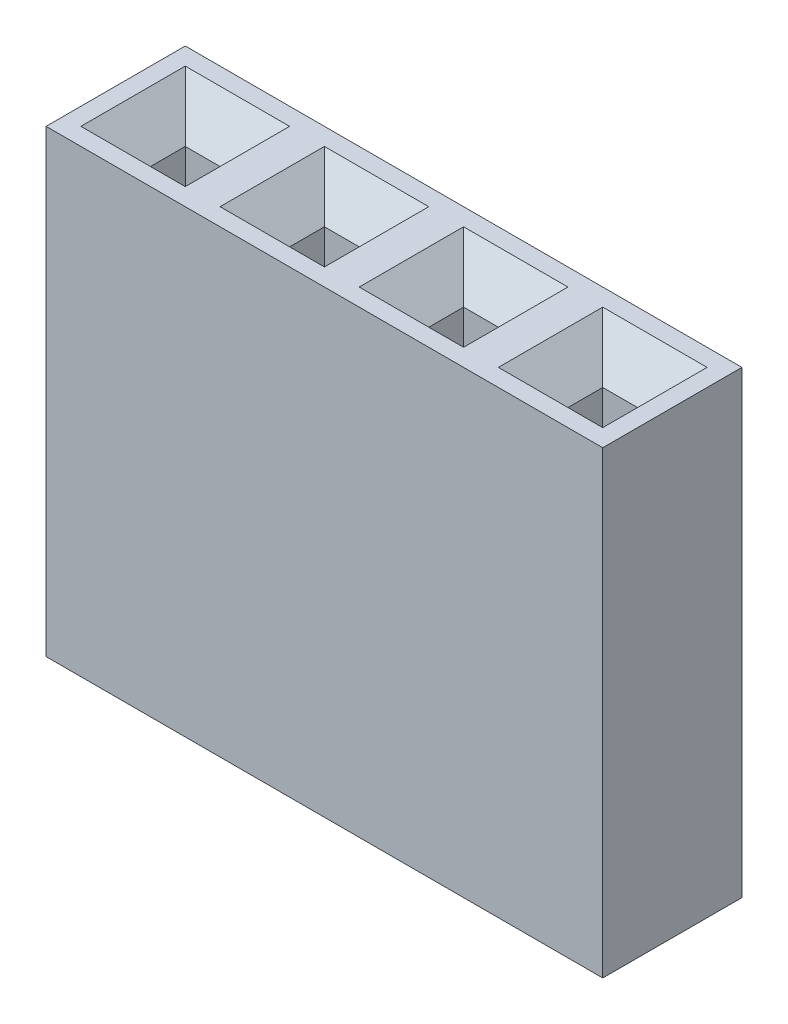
from build123d import *

# Parameters (mm, degrees)
SKETCH1_W           = 2.54
SKETCH1_H           = 2.54
SKETCH1_W_2         = 0.635
SKETCH1_H_2         = 0.635
BOSS_EXTRUDE1_DEPTH = 8.382
F_4_PINS_COUNT      = 4
F_4_PINS_PITCH      = 2.54


with BuildPart() as part:
    # Sketch1 → Boss-Extrude1 (new body)
    with BuildSketch(Plane(origin=(0, 0, 0), x_dir=(1, 0, 0), z_dir=(0, 1, 0))):
        Rectangle(SKETCH1_W, SKETCH1_H)
        Rectangle(SKETCH1_W_2, SKETCH1_H_2, mode=Mode.SUBTRACT)
    boss_extrude1 = extrude(amount=BOSS_EXTRUDE1_DEPTH)

    # Sketch3 → Cut-Loft1 section 0
    with BuildSketch(Plane(origin=(0, 7.747, 0), x_dir=(-1, 0, 0), z_dir=(0, 1, 0))):
        with BuildLine():
            Line((-0.3175, 0.3175), (0.3175, 0.3175))
            Line((0.3175, 0.3175), (0.3175, -0.3175))
            Line((0.3175, -0.3175), (-0.3175, -0.3175))
            Line((-0.3175, -0.3175), (-0.3175, 0.3175))
        make_face()
    # Sketch2 → Cut-Loft1 section 1
    with BuildSketch(Plane(origin=(0, 8.382, 0), x_dir=(1, 0, 0), z_dir=(0, 1, 0))):
        with BuildLine():
            Line((0.9525, -0.9525), (-0.9525, -0.9525))
            Line((-0.9525, -0.9525), (-0.9525, 0.9525))
            Line((-0.9525, 0.9525), (0.9525, 0.9525))
            Line((0.9525, 0.9525), (0.9525, -0.9525))
        make_face()
    cut_loft1 = loft(mode=Mode.SUBTRACT)

    # 4 pins: Boss-Extrude1, Cut-Loft1 ×4
    with Locations(*[(-i * F_4_PINS_PITCH, 0, 0) for i in range(1, F_4_PINS_COUNT)]):
        add(boss_extrude1)
        add(cut_loft1, mode=Mode.SUBTRACT)


solid = part.part
